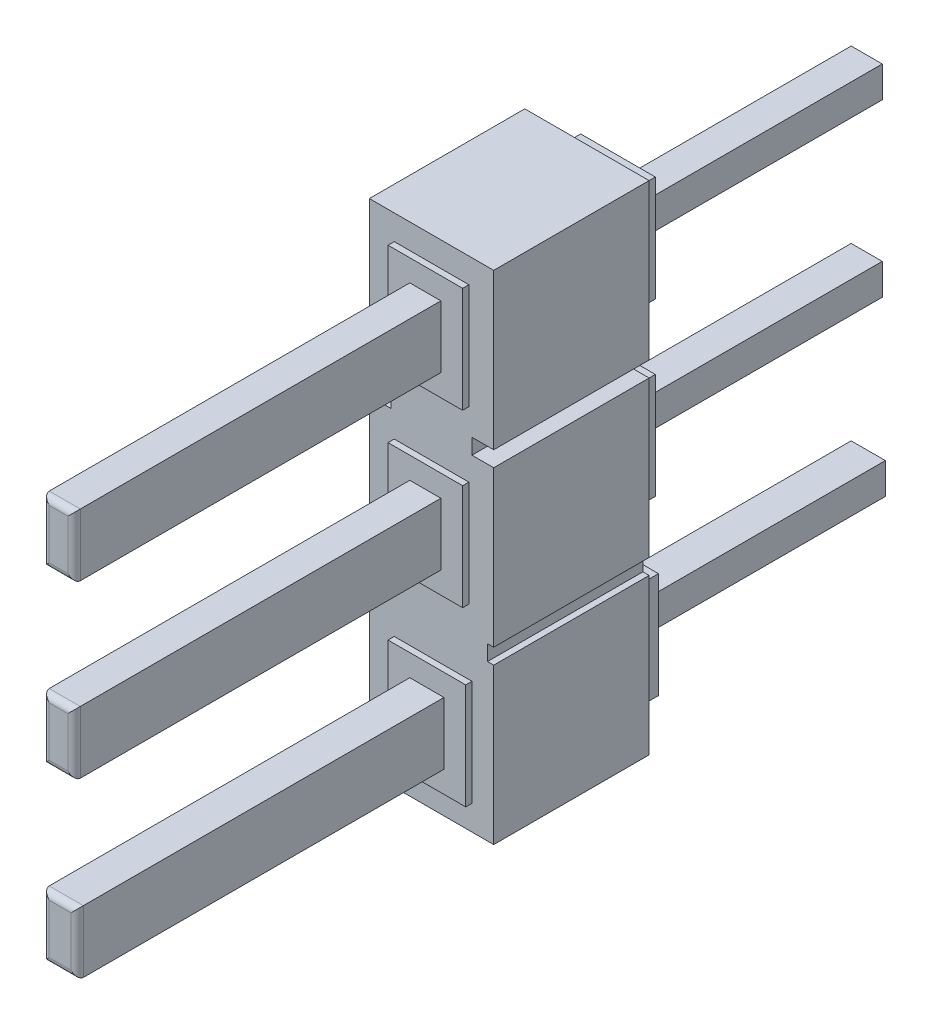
from build123d import *

# Parameters (mm, degrees)
ESQUISSE1_W             = 1.2
ESQUISSE1_H             = 1.7
ESQUISSE1_W_2           = 1.25
EXTRUSION1_DEPTH        = 2.5
ESQUISSE2_W             = 1.2
ESQUISSE2_H             = 1.7
EXTRUSION2_DEPTH        = 4.5
EXTRUSION2_2_DEPTH      = 4.5
ESQUISSE2_W_2           = 1.25
EXTRUSION2_3_DEPTH      = 4.5
ESQUISSE3_W             = 1.25
ESQUISSE3_H             = 1.7
ESQUISSE3_W_2           = 0.55
ESQUISSE3_H_2           = 1
ESQUISSE3_W_3           = 1.2
ESQUISSE3_W_4           = 0.5
ENL_V_MAT_EXTRU_1_DEPTH = 4
ESQUISSE4_W             = 1.2
ESQUISSE4_H             = 1.7
ESQUISSE4_W_2           = 1.25
EXTRUSION3_DEPTH        = 2.6
ESQUISSE5_W             = 0.5
ESQUISSE5_H             = 1
ESQUISSE5_W_2           = 0.55
EXTRUSION4_DEPTH        = 5.9
CONG_1_R                = 0.1
ESQUISSE6_W             = 0.55
ESQUISSE6_H             = 0.25
ESQUISSE6_W_2           = 0.5
ENL_V_MAT_EXTRU_2_DEPTH = 4


with BuildPart() as part:
    # Esquisse1 → Extrusion1 (new body)
    with BuildSketch(Plane.XY):
        Polygon((-1, 4), (1, 4), (1, 1.5), (0.65, 1.5), (0.65, 1.25), (1, 1.25), (1, -1.25), (0.9, -1.25), (0.9, -1.5), (1, -1.5), (1, -4), (-1, -4), (-1, -1.5), (-0.9, -1.5), (-0.9, -1.25), (-1, -1.25), (-1, 1.25), (-0.65, 1.25), (-0.65, 1.5), (-1, 1.5), align=None)
        Rectangle(ESQUISSE1_W, ESQUISSE1_H, mode=Mode.SUBTRACT)
        with Locations((0, 2.75)):
            Rectangle(ESQUISSE1_W, ESQUISSE1_H, mode=Mode.SUBTRACT)
        with Locations((0.025, -2.75)):
            Rectangle(ESQUISSE1_W_2, ESQUISSE1_H, mode=Mode.SUBTRACT)
    extrude(amount=EXTRUSION1_DEPTH)



with BuildPart() as body_2:
    # Esquisse2 → Extrusion2 (new body)
    with BuildSketch(Plane(origin=(0, 0, 0), x_dir=(-1, 0, 0), z_dir=(0, 0, -1))):
        with Locations((0, 2.75)):
            Rectangle(ESQUISSE2_W, ESQUISSE2_H)
    extrude(amount=EXTRUSION2_DEPTH)


with BuildPart() as body_3:
    # Esquisse2 → Extrusion2 2 (new body)
    with BuildSketch(Plane(origin=(0, 0, 0), x_dir=(-1, 0, 0), z_dir=(0, 0, -1))):
        Rectangle(ESQUISSE2_W, ESQUISSE2_H)
    extrude(amount=EXTRUSION2_2_DEPTH)


with BuildPart() as body_4:
    # Esquisse2 → Extrusion2 3 (new body)
    with BuildSketch(Plane(origin=(0, 0, 0), x_dir=(-1, 0, 0), z_dir=(0, 0, -1))):
        with Locations((-0.025, -2.75)):
            Rectangle(ESQUISSE2_W_2, ESQUISSE2_H)
    extrude(amount=EXTRUSION2_3_DEPTH)


with BuildPart() as enl_v_mat_extru_1_tool:
    # Esquisse3 → Enl_v. mat.-Extru.1 (new body)
    # profile 1 of 3: a face of its own
    with BuildSketch(Plane(origin=(0, 0, -4.5), x_dir=(-1, 0, 0), z_dir=(0, 0, -1))):
        with Locations((-0.025, -2.75)):
            Rectangle(ESQUISSE3_W, ESQUISSE3_H)
        with Locations((-0.025, -2.75)):
            Rectangle(ESQUISSE3_W_2, ESQUISSE3_H_2, mode=Mode.SUBTRACT)
    # profile 2 of 3: a face of its own
    with BuildSketch(Plane(origin=(0, 0, -4.5), x_dir=(-1, 0, 0), z_dir=(0, 0, -1))):
        Rectangle(ESQUISSE3_W_3, ESQUISSE3_H)
        Rectangle(ESQUISSE3_W_4, ESQUISSE3_H_2, mode=Mode.SUBTRACT)
    # profile 3 of 3: a face of its own
    with BuildSketch(Plane(origin=(0, 0, -4.5), x_dir=(-1, 0, 0), z_dir=(0, 0, -1))):
        with Locations((0, 2.75)):
            Rectangle(ESQUISSE3_W_3, ESQUISSE3_H)
        with Locations((0, 2.75)):
            Rectangle(ESQUISSE3_W_4, ESQUISSE3_H_2, mode=Mode.SUBTRACT)
    extrude(amount=-ENL_V_MAT_EXTRU_1_DEPTH)


with BuildPart() as body_2_1:
    add(body_2.part)

    # Enl_v. mat.-Extru.1: cut by enl_v_mat_extru_1_tool
    add(enl_v_mat_extru_1_tool.part, mode=Mode.SUBTRACT)


with BuildPart() as body_3_1:
    add(body_3.part)

    # Enl_v. mat.-Extru.1: cut by enl_v_mat_extru_1_tool
    add(enl_v_mat_extru_1_tool.part, mode=Mode.SUBTRACT)


with BuildPart() as body_4_1:
    add(body_4.part)

    # Enl_v. mat.-Extru.1: cut by enl_v_mat_extru_1_tool
    add(enl_v_mat_extru_1_tool.part, mode=Mode.SUBTRACT)


with BuildPart() as part_1:
    add(part.part)

    add(body_2_1.part)  # Extrusion3 merges body 2

    add(body_3_1.part)  # Extrusion3 merges body 3

    add(body_4_1.part)  # Extrusion3 merges body 4
    # Esquisse4 → Extrusion3 (add)
    with BuildSketch(Plane.XY):
        with Locations((0, 2.75)):
            Rectangle(ESQUISSE4_W, ESQUISSE4_H)
        Rectangle(ESQUISSE4_W, ESQUISSE4_H)
        with Locations((0.025, -2.75)):
            Rectangle(ESQUISSE4_W_2, ESQUISSE4_H)
    extrude(amount=EXTRUSION3_DEPTH)

    # Esquisse5 → Extrusion4 (add)
    with BuildSketch(Plane.XY.offset(2.6)):
        with Locations((0, 2.75)):
            Rectangle(ESQUISSE5_W, ESQUISSE5_H)
        Rectangle(ESQUISSE5_W, ESQUISSE5_H)
        with Locations((0.025, -2.75)):
            Rectangle(ESQUISSE5_W_2, ESQUISSE5_H)
    extrude(amount=EXTRUSION4_DEPTH)

    # Cong_1
    cong_1_edges = [part_1.edges().sort_by_distance(p)[0] for p in [
        (0, 2.25, 8.5),
        (0.25, 2.75, 8.5),
        (0, 3.25, 8.5),
        (-0.25, 2.75, 8.5),
        (0, -0.5, 8.5),
        (0.25, 0, 8.5),
        (0, 0.5, 8.5),
        (-0.25, 0, 8.5),
        (0.025, -3.25, 8.5),
        (0.3, -2.75, 8.5),
        (0.025, -2.25, 8.5),
        (-0.25, -2.75, 8.5),
    ]]
    fillet(cong_1_edges, radius=CONG_1_R)

    # Esquisse6 → Enl_v. mat.-Extru.2 (cut)
    with BuildSketch(Plane(origin=(0, 0, -4.5), x_dir=(-1, 0, 0), z_dir=(0, 0, -1))):
        with Locations((-0.025, -3.125)):
            Rectangle(ESQUISSE6_W, ESQUISSE6_H)
        with Locations((-0.025, -2.375)):
            Rectangle(ESQUISSE6_W, ESQUISSE6_H)
        with Locations((0, -0.375)):
            Rectangle(ESQUISSE6_W_2, ESQUISSE6_H)
        with Locations((0, 0.375)):
            Rectangle(ESQUISSE6_W_2, ESQUISSE6_H)
        with Locations((0, 3.125)):
            Rectangle(ESQUISSE6_W_2, ESQUISSE6_H)
        with Locations((0, 2.375)):
            Rectangle(ESQUISSE6_W_2, ESQUISSE6_H)
    extrude(amount=-ENL_V_MAT_EXTRU_2_DEPTH, mode=Mode.SUBTRACT)


solid = part_1.part
